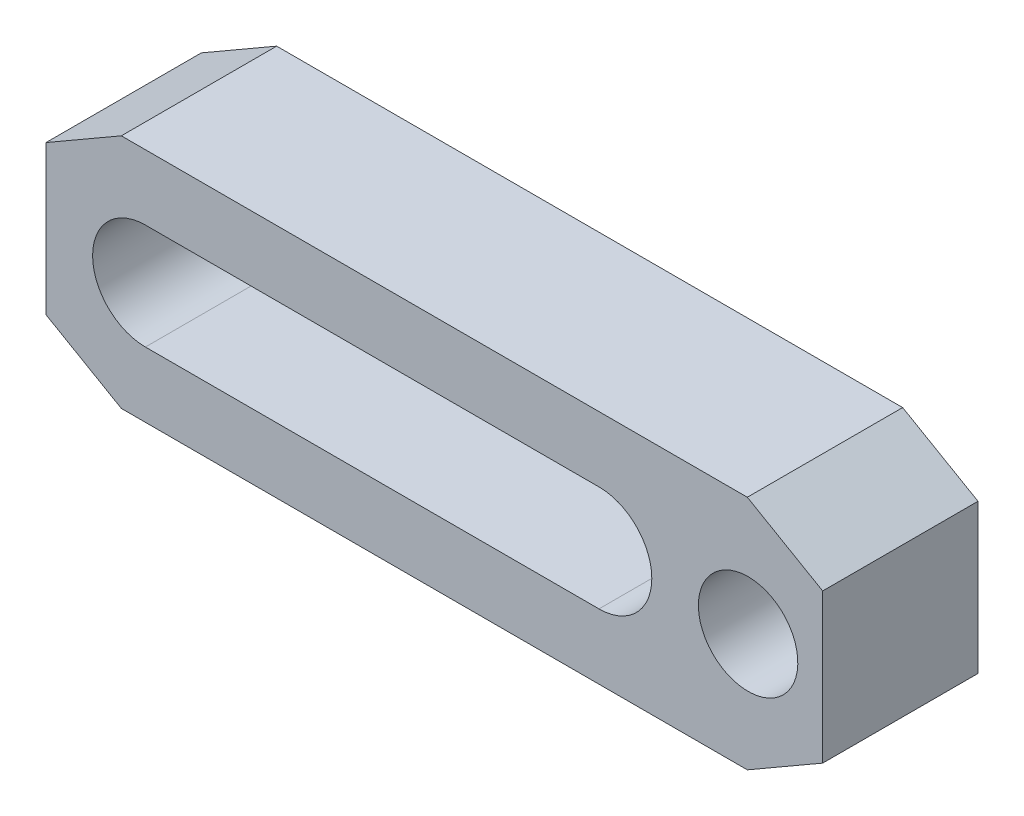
ISO-10303-21;
HEADER;
FILE_DESCRIPTION(('STEP AP214'),'2;1');
FILE_NAME('part.step','',(''),(''),'','','');
FILE_SCHEMA(('AUTOMOTIVE_DESIGN { 1 0 10303 214 1 1 1 1 }'));
ENDSEC;
DATA;
#1=APPLICATION_CONTEXT('core data for automotive mechanical design processes');
#2=APPLICATION_PROTOCOL_DEFINITION('international standard','automotive_design',2000,#1);
#3=PRODUCT_CONTEXT('',#1,'mechanical');
#4=PRODUCT('Part','Part','',(#3));
#5=PRODUCT_RELATED_PRODUCT_CATEGORY('part','',(#4));
#6=PRODUCT_DEFINITION_FORMATION('','',#4);
#7=PRODUCT_DEFINITION_CONTEXT('part definition',#1,'design');
#8=PRODUCT_DEFINITION('design','',#6,#7);
#9=PRODUCT_DEFINITION_SHAPE('','',#8);
#10=(LENGTH_UNIT() NAMED_UNIT(*) SI_UNIT(.MILLI.,.METRE.));
#11=(NAMED_UNIT(*) PLANE_ANGLE_UNIT() SI_UNIT($,.RADIAN.));
#12=(NAMED_UNIT(*) SI_UNIT($,.STERADIAN.) SOLID_ANGLE_UNIT());
#13=UNCERTAINTY_MEASURE_WITH_UNIT(LENGTH_MEASURE(1.E-05),#10,'distance_accuracy_value','');
#14=(GEOMETRIC_REPRESENTATION_CONTEXT(3) GLOBAL_UNCERTAINTY_ASSIGNED_CONTEXT((#13)) GLOBAL_UNIT_ASSIGNED_CONTEXT((#10,
#11,#12)) REPRESENTATION_CONTEXT('',''));
#15=CARTESIAN_POINT('',(0.,0.,0.));
#16=DIRECTION('',(0.,0.,1.));
#17=DIRECTION('',(1.,0.,0.));
#18=AXIS2_PLACEMENT_3D('',#15,#16,#17);
#19=CARTESIAN_POINT('',(-26.5,48.0843918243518,25.));
#20=DIRECTION('',(0.,0.,1.));
#21=DIRECTION('',(0.,1.,0.));
#22=AXIS2_PLACEMENT_3D('',#19,#20,#21);
#23=PLANE('',#22);
#24=CARTESIAN_POINT('',(24.,0.,25.));
#25=DIRECTION('',(0.,0.,1.));
#26=DIRECTION('',(0.,1.,0.));
#27=AXIS2_PLACEMENT_3D('',#24,#25,#26);
#28=CIRCLE('',#27,8.);
#29=CARTESIAN_POINT('',(24.,8.,25.));
#30=VERTEX_POINT('',#29);
#31=EDGE_CURVE('E124',#30,#30,#28,.T.);
#32=ORIENTED_EDGE('',*,*,#31,.F.);
#33=EDGE_LOOP('',(#32));
#34=FACE_BOUND('',#33,.T.);
#35=DIRECTION('',(-0.866025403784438,-0.5,0.));
#36=VECTOR('',#35,1.);
#37=CARTESIAN_POINT('',(-89.,12.,25.));
#38=LINE('',#37,#36);
#39=CARTESIAN_POINT('',(-76.8756443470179,19.,25.));
#40=VERTEX_POINT('',#39);
#41=CARTESIAN_POINT('',(-89.,12.,25.));
#42=VERTEX_POINT('',#41);
#43=EDGE_CURVE('E160',#40,#42,#38,.T.);
#44=ORIENTED_EDGE('',*,*,#43,.T.);
#45=DIRECTION('',(0.,-1.,0.));
#46=VECTOR('',#45,1.);
#47=CARTESIAN_POINT('',(-89.,-12.,25.));
#48=LINE('',#47,#46);
#49=CARTESIAN_POINT('',(-89.,-12.,25.));
#50=VERTEX_POINT('',#49);
#51=EDGE_CURVE('E163',#42,#50,#48,.T.);
#52=ORIENTED_EDGE('',*,*,#51,.T.);
#53=DIRECTION('',(0.866025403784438,-0.5,0.));
#54=VECTOR('',#53,1.);
#55=CARTESIAN_POINT('',(-89.,-12.,25.));
#56=LINE('',#55,#54);
#57=CARTESIAN_POINT('',(-76.8756443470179,-19.,25.));
#58=VERTEX_POINT('',#57);
#59=EDGE_CURVE('E165',#50,#58,#56,.T.);
#60=ORIENTED_EDGE('',*,*,#59,.T.);
#61=DIRECTION('',(1.,0.,0.));
#62=VECTOR('',#61,1.);
#63=CARTESIAN_POINT('',(23.8756443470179,-19.,25.));
#64=LINE('',#63,#62);
#65=CARTESIAN_POINT('',(23.8756443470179,-19.,25.));
#66=VERTEX_POINT('',#65);
#67=EDGE_CURVE('E167',#58,#66,#64,.T.);
#68=ORIENTED_EDGE('',*,*,#67,.T.);
#69=DIRECTION('',(0.866025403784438,0.5,0.));
#70=VECTOR('',#69,1.);
#71=CARTESIAN_POINT('',(36.,-12.,25.));
#72=LINE('',#71,#70);
#73=CARTESIAN_POINT('',(36.,-12.,25.));
#74=VERTEX_POINT('',#73);
#75=EDGE_CURVE('E169',#66,#74,#72,.T.);
#76=ORIENTED_EDGE('',*,*,#75,.T.);
#77=DIRECTION('',(0.,1.,0.));
#78=VECTOR('',#77,1.);
#79=CARTESIAN_POINT('',(36.,-12.,25.));
#80=LINE('',#79,#78);
#81=CARTESIAN_POINT('',(36.,12.,25.));
#82=VERTEX_POINT('',#81);
#83=EDGE_CURVE('E171',#74,#82,#80,.T.);
#84=ORIENTED_EDGE('',*,*,#83,.T.);
#85=DIRECTION('',(-0.866025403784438,0.5,0.));
#86=VECTOR('',#85,1.);
#87=CARTESIAN_POINT('',(36.,12.,25.));
#88=LINE('',#87,#86);
#89=CARTESIAN_POINT('',(23.8756443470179,19.,25.));
#90=VERTEX_POINT('',#89);
#91=EDGE_CURVE('E173',#82,#90,#88,.T.);
#92=ORIENTED_EDGE('',*,*,#91,.T.);
#93=DIRECTION('',(-1.,0.,0.));
#94=VECTOR('',#93,1.);
#95=CARTESIAN_POINT('',(23.8756443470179,19.,25.));
#96=LINE('',#95,#94);
#97=EDGE_CURVE('E175',#90,#40,#96,.T.);
#98=ORIENTED_EDGE('',*,*,#97,.T.);
#99=EDGE_LOOP('',(#44,#52,#60,#68,#76,#84,#92,#98));
#100=FACE_BOUND('',#99,.T.);
#101=DIRECTION('',(-1.,0.,0.));
#102=VECTOR('',#101,1.);
#103=CARTESIAN_POINT('',(0.,8.5,25.));
#104=LINE('',#103,#102);
#105=CARTESIAN_POINT('',(0.,8.5,25.));
#106=VERTEX_POINT('',#105);
#107=CARTESIAN_POINT('',(-73.,8.5,25.));
#108=VERTEX_POINT('',#107);
#109=EDGE_CURVE('E134',#106,#108,#104,.T.);
#110=ORIENTED_EDGE('',*,*,#109,.F.);
#111=CARTESIAN_POINT('',(0.,0.,25.));
#112=DIRECTION('',(0.,0.,1.));
#113=DIRECTION('',(0.,1.,0.));
#114=AXIS2_PLACEMENT_3D('',#111,#112,#113);
#115=CIRCLE('',#114,8.5);
#116=CARTESIAN_POINT('',(0.,-8.5,25.));
#117=VERTEX_POINT('',#116);
#118=EDGE_CURVE('E118',#117,#106,#115,.T.);
#119=ORIENTED_EDGE('',*,*,#118,.F.);
#120=DIRECTION('',(1.,0.,0.));
#121=VECTOR('',#120,1.);
#122=CARTESIAN_POINT('',(0.,-8.5,25.));
#123=LINE('',#122,#121);
#124=CARTESIAN_POINT('',(-73.,-8.5,25.));
#125=VERTEX_POINT('',#124);
#126=EDGE_CURVE('E138',#125,#117,#123,.T.);
#127=ORIENTED_EDGE('',*,*,#126,.F.);
#128=CARTESIAN_POINT('',(-73.,0.,25.));
#129=DIRECTION('',(0.,0.,1.));
#130=DIRECTION('',(0.,1.,0.));
#131=AXIS2_PLACEMENT_3D('',#128,#129,#130);
#132=CIRCLE('',#131,8.5);
#133=EDGE_CURVE('E136',#108,#125,#132,.T.);
#134=ORIENTED_EDGE('',*,*,#133,.F.);
#135=EDGE_LOOP('',(#110,#119,#127,#134));
#136=FACE_BOUND('',#135,.T.);
#137=ADVANCED_FACE('F14',(#34,#100,#136),#23,.T.);
#138=CARTESIAN_POINT('',(-26.5,48.0843918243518,0.));
#139=DIRECTION('',(0.,0.,1.));
#140=DIRECTION('',(0.,1.,0.));
#141=AXIS2_PLACEMENT_3D('',#138,#139,#140);
#142=PLANE('',#141);
#143=CARTESIAN_POINT('',(24.,0.,0.));
#144=DIRECTION('',(0.,0.,1.));
#145=DIRECTION('',(0.,1.,0.));
#146=AXIS2_PLACEMENT_3D('',#143,#144,#145);
#147=CIRCLE('',#146,8.);
#148=CARTESIAN_POINT('',(24.,8.,0.));
#149=VERTEX_POINT('',#148);
#150=EDGE_CURVE('E127',#149,#149,#147,.T.);
#151=ORIENTED_EDGE('',*,*,#150,.T.);
#152=EDGE_LOOP('',(#151));
#153=FACE_BOUND('',#152,.T.);
#154=DIRECTION('',(-0.866025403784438,-0.5,0.));
#155=VECTOR('',#154,1.);
#156=CARTESIAN_POINT('',(-89.,12.,0.));
#157=LINE('',#156,#155);
#158=CARTESIAN_POINT('',(-76.8756443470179,19.,0.));
#159=VERTEX_POINT('',#158);
#160=CARTESIAN_POINT('',(-89.,12.,0.));
#161=VERTEX_POINT('',#160);
#162=EDGE_CURVE('E119',#159,#161,#157,.T.);
#163=ORIENTED_EDGE('',*,*,#162,.F.);
#164=DIRECTION('',(-1.,0.,0.));
#165=VECTOR('',#164,1.);
#166=CARTESIAN_POINT('',(23.8756443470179,19.,0.));
#167=LINE('',#166,#165);
#168=CARTESIAN_POINT('',(23.8756443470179,19.,0.));
#169=VERTEX_POINT('',#168);
#170=EDGE_CURVE('E158',#169,#159,#167,.T.);
#171=ORIENTED_EDGE('',*,*,#170,.F.);
#172=DIRECTION('',(-0.866025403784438,0.5,0.));
#173=VECTOR('',#172,1.);
#174=CARTESIAN_POINT('',(36.,12.,0.));
#175=LINE('',#174,#173);
#176=CARTESIAN_POINT('',(36.,12.,0.));
#177=VERTEX_POINT('',#176);
#178=EDGE_CURVE('E156',#177,#169,#175,.T.);
#179=ORIENTED_EDGE('',*,*,#178,.F.);
#180=DIRECTION('',(0.,1.,0.));
#181=VECTOR('',#180,1.);
#182=CARTESIAN_POINT('',(36.,-12.,0.));
#183=LINE('',#182,#181);
#184=CARTESIAN_POINT('',(36.,-12.,0.));
#185=VERTEX_POINT('',#184);
#186=EDGE_CURVE('E154',#185,#177,#183,.T.);
#187=ORIENTED_EDGE('',*,*,#186,.F.);
#188=DIRECTION('',(0.866025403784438,0.5,0.));
#189=VECTOR('',#188,1.);
#190=CARTESIAN_POINT('',(36.,-12.,0.));
#191=LINE('',#190,#189);
#192=CARTESIAN_POINT('',(23.8756443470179,-19.,0.));
#193=VERTEX_POINT('',#192);
#194=EDGE_CURVE('E152',#193,#185,#191,.T.);
#195=ORIENTED_EDGE('',*,*,#194,.F.);
#196=DIRECTION('',(1.,0.,0.));
#197=VECTOR('',#196,1.);
#198=CARTESIAN_POINT('',(23.8756443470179,-19.,0.));
#199=LINE('',#198,#197);
#200=CARTESIAN_POINT('',(-76.8756443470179,-19.,0.));
#201=VERTEX_POINT('',#200);
#202=EDGE_CURVE('E150',#201,#193,#199,.T.);
#203=ORIENTED_EDGE('',*,*,#202,.F.);
#204=DIRECTION('',(0.866025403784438,-0.5,0.));
#205=VECTOR('',#204,1.);
#206=CARTESIAN_POINT('',(-89.,-12.,0.));
#207=LINE('',#206,#205);
#208=CARTESIAN_POINT('',(-89.,-12.,0.));
#209=VERTEX_POINT('',#208);
#210=EDGE_CURVE('E148',#209,#201,#207,.T.);
#211=ORIENTED_EDGE('',*,*,#210,.F.);
#212=DIRECTION('',(0.,-1.,0.));
#213=VECTOR('',#212,1.);
#214=CARTESIAN_POINT('',(-89.,-12.,0.));
#215=LINE('',#214,#213);
#216=EDGE_CURVE('E146',#161,#209,#215,.T.);
#217=ORIENTED_EDGE('',*,*,#216,.F.);
#218=EDGE_LOOP('',(#163,#171,#179,#187,#195,#203,#211,#217));
#219=FACE_BOUND('',#218,.T.);
#220=CARTESIAN_POINT('',(0.,0.,0.));
#221=DIRECTION('',(0.,0.,1.));
#222=DIRECTION('',(0.,1.,0.));
#223=AXIS2_PLACEMENT_3D('',#220,#221,#222);
#224=CIRCLE('',#223,8.5);
#225=CARTESIAN_POINT('',(0.,-8.5,0.));
#226=VERTEX_POINT('',#225);
#227=CARTESIAN_POINT('',(0.,8.5,0.));
#228=VERTEX_POINT('',#227);
#229=EDGE_CURVE('E37',#226,#228,#224,.T.);
#230=ORIENTED_EDGE('',*,*,#229,.T.);
#231=DIRECTION('',(-1.,0.,0.));
#232=VECTOR('',#231,1.);
#233=CARTESIAN_POINT('',(0.,8.5,0.));
#234=LINE('',#233,#232);
#235=CARTESIAN_POINT('',(-73.,8.5,0.));
#236=VERTEX_POINT('',#235);
#237=EDGE_CURVE('E105',#228,#236,#234,.T.);
#238=ORIENTED_EDGE('',*,*,#237,.T.);
#239=CARTESIAN_POINT('',(-73.,0.,0.));
#240=DIRECTION('',(0.,0.,1.));
#241=DIRECTION('',(0.,1.,0.));
#242=AXIS2_PLACEMENT_3D('',#239,#240,#241);
#243=CIRCLE('',#242,8.5);
#244=CARTESIAN_POINT('',(-73.,-8.5,0.));
#245=VERTEX_POINT('',#244);
#246=EDGE_CURVE('E114',#236,#245,#243,.T.);
#247=ORIENTED_EDGE('',*,*,#246,.T.);
#248=DIRECTION('',(1.,0.,0.));
#249=VECTOR('',#248,1.);
#250=CARTESIAN_POINT('',(0.,-8.5,0.));
#251=LINE('',#250,#249);
#252=EDGE_CURVE('E123',#245,#226,#251,.T.);
#253=ORIENTED_EDGE('',*,*,#252,.T.);
#254=EDGE_LOOP('',(#230,#238,#247,#253));
#255=FACE_BOUND('',#254,.T.);
#256=ADVANCED_FACE('F122',(#153,#219,#255),#142,.F.);
#257=CARTESIAN_POINT('',(-89.,12.,25.));
#258=DIRECTION('',(0.5,-0.866025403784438,0.));
#259=DIRECTION('',(0.866025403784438,0.5,0.));
#260=AXIS2_PLACEMENT_3D('',#257,#258,#259);
#261=PLANE('',#260);
#262=ORIENTED_EDGE('',*,*,#162,.T.);
#263=DIRECTION('',(0.,0.,-1.));
#264=VECTOR('',#263,1.);
#265=CARTESIAN_POINT('',(-89.,12.,25.));
#266=LINE('',#265,#264);
#267=EDGE_CURVE('E9',#42,#161,#266,.T.);
#268=ORIENTED_EDGE('',*,*,#267,.F.);
#269=ORIENTED_EDGE('',*,*,#43,.F.);
#270=DIRECTION('',(0.,0.,-1.));
#271=VECTOR('',#270,1.);
#272=CARTESIAN_POINT('',(-76.8756443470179,19.,25.));
#273=LINE('',#272,#271);
#274=EDGE_CURVE('E177',#40,#159,#273,.T.);
#275=ORIENTED_EDGE('',*,*,#274,.T.);
#276=EDGE_LOOP('',(#262,#268,#269,#275));
#277=FACE_BOUND('',#276,.T.);
#278=ADVANCED_FACE('F16',(#277),#261,.F.);
#279=CARTESIAN_POINT('',(-89.,-12.,25.));
#280=DIRECTION('',(1.,0.,0.));
#281=DIRECTION('',(0.,1.,0.));
#282=AXIS2_PLACEMENT_3D('',#279,#280,#281);
#283=PLANE('',#282);
#284=ORIENTED_EDGE('',*,*,#216,.T.);
#285=DIRECTION('',(0.,0.,-1.));
#286=VECTOR('',#285,1.);
#287=CARTESIAN_POINT('',(-89.,-12.,25.));
#288=LINE('',#287,#286);
#289=EDGE_CURVE('E22',#50,#209,#288,.T.);
#290=ORIENTED_EDGE('',*,*,#289,.F.);
#291=ORIENTED_EDGE('',*,*,#51,.F.);
#292=ORIENTED_EDGE('',*,*,#267,.T.);
#293=EDGE_LOOP('',(#284,#290,#291,#292));
#294=FACE_BOUND('',#293,.T.);
#295=ADVANCED_FACE('F221',(#294),#283,.F.);
#296=CARTESIAN_POINT('',(-89.,-12.,25.));
#297=DIRECTION('',(0.5,0.866025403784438,0.));
#298=DIRECTION('',(-0.866025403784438,0.5,0.));
#299=AXIS2_PLACEMENT_3D('',#296,#297,#298);
#300=PLANE('',#299);
#301=ORIENTED_EDGE('',*,*,#210,.T.);
#302=DIRECTION('',(0.,0.,-1.));
#303=VECTOR('',#302,1.);
#304=CARTESIAN_POINT('',(-76.8756443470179,-19.,25.));
#305=LINE('',#304,#303);
#306=EDGE_CURVE('E192',#58,#201,#305,.T.);
#307=ORIENTED_EDGE('',*,*,#306,.F.);
#308=ORIENTED_EDGE('',*,*,#59,.F.);
#309=ORIENTED_EDGE('',*,*,#289,.T.);
#310=EDGE_LOOP('',(#301,#307,#308,#309));
#311=FACE_BOUND('',#310,.T.);
#312=ADVANCED_FACE('F199',(#311),#300,.F.);
#313=CARTESIAN_POINT('',(23.8756443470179,-19.,25.));
#314=DIRECTION('',(0.,1.,0.));
#315=DIRECTION('',(-1.,0.,0.));
#316=AXIS2_PLACEMENT_3D('',#313,#314,#315);
#317=PLANE('',#316);
#318=ORIENTED_EDGE('',*,*,#202,.T.);
#319=DIRECTION('',(0.,0.,-1.));
#320=VECTOR('',#319,1.);
#321=CARTESIAN_POINT('',(23.8756443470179,-19.,25.));
#322=LINE('',#321,#320);
#323=EDGE_CURVE('E189',#66,#193,#322,.T.);
#324=ORIENTED_EDGE('',*,*,#323,.F.);
#325=ORIENTED_EDGE('',*,*,#67,.F.);
#326=ORIENTED_EDGE('',*,*,#306,.T.);
#327=EDGE_LOOP('',(#318,#324,#325,#326));
#328=FACE_BOUND('',#327,.T.);
#329=ADVANCED_FACE('F209',(#328),#317,.F.);
#330=CARTESIAN_POINT('',(36.,-12.,25.));
#331=DIRECTION('',(-0.5,0.866025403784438,0.));
#332=DIRECTION('',(-0.866025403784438,-0.5,0.));
#333=AXIS2_PLACEMENT_3D('',#330,#331,#332);
#334=PLANE('',#333);
#335=ORIENTED_EDGE('',*,*,#194,.T.);
#336=DIRECTION('',(0.,0.,-1.));
#337=VECTOR('',#336,1.);
#338=CARTESIAN_POINT('',(36.,-12.,25.));
#339=LINE('',#338,#337);
#340=EDGE_CURVE('E186',#74,#185,#339,.T.);
#341=ORIENTED_EDGE('',*,*,#340,.F.);
#342=ORIENTED_EDGE('',*,*,#75,.F.);
#343=ORIENTED_EDGE('',*,*,#323,.T.);
#344=EDGE_LOOP('',(#335,#341,#342,#343));
#345=FACE_BOUND('',#344,.T.);
#346=ADVANCED_FACE('F213',(#345),#334,.F.);
#347=CARTESIAN_POINT('',(36.,-12.,25.));
#348=DIRECTION('',(-1.,0.,0.));
#349=DIRECTION('',(0.,-1.,0.));
#350=AXIS2_PLACEMENT_3D('',#347,#348,#349);
#351=PLANE('',#350);
#352=ORIENTED_EDGE('',*,*,#186,.T.);
#353=DIRECTION('',(0.,0.,-1.));
#354=VECTOR('',#353,1.);
#355=CARTESIAN_POINT('',(36.,12.,25.));
#356=LINE('',#355,#354);
#357=EDGE_CURVE('E183',#82,#177,#356,.T.);
#358=ORIENTED_EDGE('',*,*,#357,.F.);
#359=ORIENTED_EDGE('',*,*,#83,.F.);
#360=ORIENTED_EDGE('',*,*,#340,.T.);
#361=EDGE_LOOP('',(#352,#358,#359,#360));
#362=FACE_BOUND('',#361,.T.);
#363=ADVANCED_FACE('F234',(#362),#351,.F.);
#364=CARTESIAN_POINT('',(36.,12.,25.));
#365=DIRECTION('',(-0.5,-0.866025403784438,0.));
#366=DIRECTION('',(0.866025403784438,-0.5,0.));
#367=AXIS2_PLACEMENT_3D('',#364,#365,#366);
#368=PLANE('',#367);
#369=ORIENTED_EDGE('',*,*,#178,.T.);
#370=DIRECTION('',(0.,0.,-1.));
#371=VECTOR('',#370,1.);
#372=CARTESIAN_POINT('',(23.8756443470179,19.,25.));
#373=LINE('',#372,#371);
#374=EDGE_CURVE('E180',#90,#169,#373,.T.);
#375=ORIENTED_EDGE('',*,*,#374,.F.);
#376=ORIENTED_EDGE('',*,*,#91,.F.);
#377=ORIENTED_EDGE('',*,*,#357,.T.);
#378=EDGE_LOOP('',(#369,#375,#376,#377));
#379=FACE_BOUND('',#378,.T.);
#380=ADVANCED_FACE('F232',(#379),#368,.F.);
#381=CARTESIAN_POINT('',(23.8756443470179,19.,25.));
#382=DIRECTION('',(0.,-1.,0.));
#383=DIRECTION('',(1.,0.,0.));
#384=AXIS2_PLACEMENT_3D('',#381,#382,#383);
#385=PLANE('',#384);
#386=ORIENTED_EDGE('',*,*,#170,.T.);
#387=ORIENTED_EDGE('',*,*,#274,.F.);
#388=ORIENTED_EDGE('',*,*,#97,.F.);
#389=ORIENTED_EDGE('',*,*,#374,.T.);
#390=EDGE_LOOP('',(#386,#387,#388,#389));
#391=FACE_BOUND('',#390,.T.);
#392=ADVANCED_FACE('F227',(#391),#385,.F.);
#393=CARTESIAN_POINT('',(0.,0.,25.));
#394=DIRECTION('',(0.,0.,-1.));
#395=DIRECTION('',(0.,-1.,0.));
#396=AXIS2_PLACEMENT_3D('',#393,#394,#395);
#397=CYLINDRICAL_SURFACE('',#396,8.5);
#398=ORIENTED_EDGE('',*,*,#229,.F.);
#399=DIRECTION('',(0.,0.,-1.));
#400=VECTOR('',#399,1.);
#401=CARTESIAN_POINT('',(0.,-8.5,25.));
#402=LINE('',#401,#400);
#403=EDGE_CURVE('E140',#117,#226,#402,.T.);
#404=ORIENTED_EDGE('',*,*,#403,.F.);
#405=ORIENTED_EDGE('',*,*,#118,.T.);
#406=DIRECTION('',(0.,0.,-1.));
#407=VECTOR('',#406,1.);
#408=CARTESIAN_POINT('',(0.,8.5,25.));
#409=LINE('',#408,#407);
#410=EDGE_CURVE('E107',#106,#228,#409,.T.);
#411=ORIENTED_EDGE('',*,*,#410,.T.);
#412=EDGE_LOOP('',(#398,#404,#405,#411));
#413=FACE_BOUND('',#412,.T.);
#414=ADVANCED_FACE('F116',(#413),#397,.F.);
#415=CARTESIAN_POINT('',(0.,8.5,25.));
#416=DIRECTION('',(0.,-1.,0.));
#417=DIRECTION('',(1.,0.,0.));
#418=AXIS2_PLACEMENT_3D('',#415,#416,#417);
#419=PLANE('',#418);
#420=ORIENTED_EDGE('',*,*,#237,.F.);
#421=ORIENTED_EDGE('',*,*,#410,.F.);
#422=ORIENTED_EDGE('',*,*,#109,.T.);
#423=DIRECTION('',(0.,0.,-1.));
#424=VECTOR('',#423,1.);
#425=CARTESIAN_POINT('',(-73.,8.5,25.));
#426=LINE('',#425,#424);
#427=EDGE_CURVE('E110',#108,#236,#426,.T.);
#428=ORIENTED_EDGE('',*,*,#427,.T.);
#429=EDGE_LOOP('',(#420,#421,#422,#428));
#430=FACE_BOUND('',#429,.T.);
#431=ADVANCED_FACE('F106',(#430),#419,.T.);
#432=CARTESIAN_POINT('',(-73.,0.,25.));
#433=DIRECTION('',(0.,0.,-1.));
#434=DIRECTION('',(0.,-1.,0.));
#435=AXIS2_PLACEMENT_3D('',#432,#433,#434);
#436=CYLINDRICAL_SURFACE('',#435,8.5);
#437=ORIENTED_EDGE('',*,*,#246,.F.);
#438=ORIENTED_EDGE('',*,*,#427,.F.);
#439=ORIENTED_EDGE('',*,*,#133,.T.);
#440=DIRECTION('',(0.,0.,-1.));
#441=VECTOR('',#440,1.);
#442=CARTESIAN_POINT('',(-73.,-8.5,25.));
#443=LINE('',#442,#441);
#444=EDGE_CURVE('E29',#125,#245,#443,.T.);
#445=ORIENTED_EDGE('',*,*,#444,.T.);
#446=EDGE_LOOP('',(#437,#438,#439,#445));
#447=FACE_BOUND('',#446,.T.);
#448=ADVANCED_FACE('F262',(#447),#436,.F.);
#449=CARTESIAN_POINT('',(0.,-8.5,25.));
#450=DIRECTION('',(0.,1.,0.));
#451=DIRECTION('',(-1.,0.,0.));
#452=AXIS2_PLACEMENT_3D('',#449,#450,#451);
#453=PLANE('',#452);
#454=ORIENTED_EDGE('',*,*,#252,.F.);
#455=ORIENTED_EDGE('',*,*,#444,.F.);
#456=ORIENTED_EDGE('',*,*,#126,.T.);
#457=ORIENTED_EDGE('',*,*,#403,.T.);
#458=EDGE_LOOP('',(#454,#455,#456,#457));
#459=FACE_BOUND('',#458,.T.);
#460=ADVANCED_FACE('F267',(#459),#453,.T.);
#461=CARTESIAN_POINT('',(24.,0.,25.));
#462=DIRECTION('',(0.,0.,1.));
#463=DIRECTION('',(0.,1.,0.));
#464=AXIS2_PLACEMENT_3D('',#461,#462,#463);
#465=CYLINDRICAL_SURFACE('',#464,8.);
#466=ORIENTED_EDGE('',*,*,#150,.F.);
#467=EDGE_LOOP('',(#466));
#468=FACE_BOUND('',#467,.T.);
#469=ORIENTED_EDGE('',*,*,#31,.T.);
#470=EDGE_LOOP('',(#469));
#471=FACE_BOUND('',#470,.T.);
#472=ADVANCED_FACE('F271',(#468,#471),#465,.F.);
#473=CLOSED_SHELL('',(#137,#256,#278,#295,#312,#329,#346,#363,#380,#392,#414,#431,#448,#460,#472));
#474=MANIFOLD_SOLID_BREP('B1',#473);
#475=ADVANCED_BREP_SHAPE_REPRESENTATION('',(#18,#474),#14);
#476=SHAPE_DEFINITION_REPRESENTATION(#9,#475);
ENDSEC;
END-ISO-10303-21;
